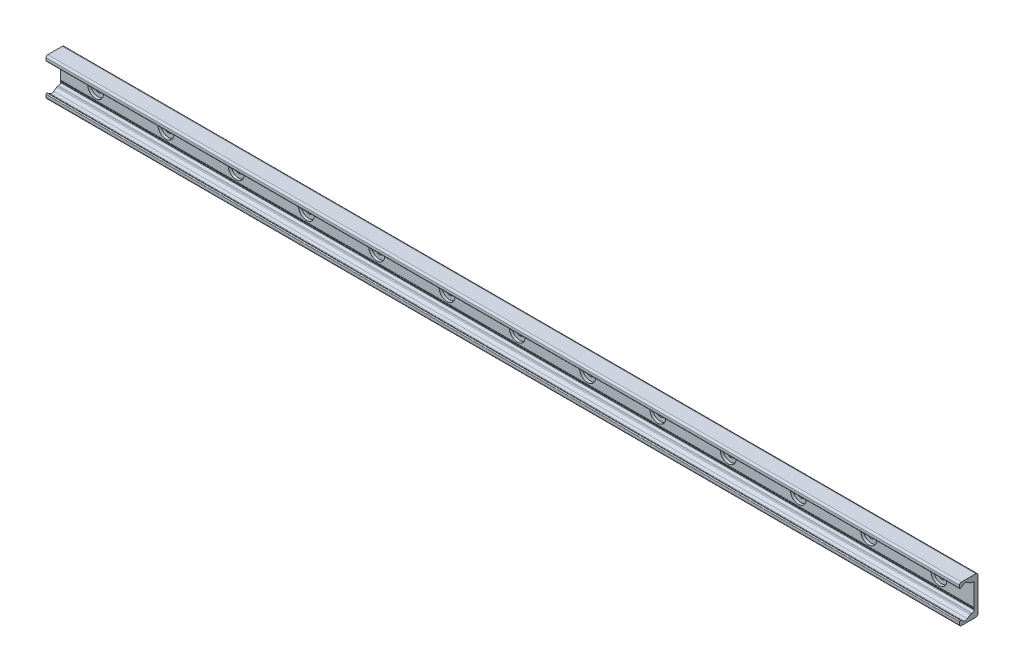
from build123d import *

# Parameters (mm, degrees)
BOSS_EXTRUDE1_DEPTH = 520
SKETCH2_R           = 9
SKETCH2_R_2         = 4.5
CUT_EXTRUDE1_DEPTH  = 3.1
SKETCH2_2_R         = 4.5
CUT_EXTRUDE2_DEPTH  = 521.705771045
LPATTERN1_COUNT     = 13
LPATTERN1_PITCH     = 80


with BuildPart() as part:
    # Sketch1 → Boss-Extrude1 (new, symmetric)
    with BuildSketch(Plane(origin=(0, 0, 0), x_dir=(0, 0, -1), z_dir=(1, 0, 0))):
        with BuildLine():
            Line((0, 0), (0, 19))
            ThreePointArc((0, 19), (-0.732233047, 20.767766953), (-2.5, 21.5))
            Line((-2.5, 21.5), (-19, 21.5))
            ThreePointArc((-19, 21.5), (-20.414213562, 20.914213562), (-21, 19.5))
            Line((-21, 19.5), (-21, 16.625057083))
            ThreePointArc((-21, 16.625057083), (-20.553251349, 15.888838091), (-19.693931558, 15.945160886))
            Line((-19.693931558, 15.945160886), (-16.794305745, 17.975500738))
            ThreePointArc((-16.794305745, 17.975500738), (-14.5, 18.69889256), (-12.205694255, 17.975500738))
            Line((-12.205694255, 17.975500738), (-8.829831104, 15.611695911))
            ThreePointArc((-8.829831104, 15.611695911), (-8.28408983, 15.342566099), (-7.682678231, 15.25))
            Line((-7.682678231, 15.25), (-6.5, 15.25))
            ThreePointArc((-6.5, 15.25), (-5.085786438, 14.664213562), (-4.5, 13.25))
            Line((-4.5, 13.25), (-4.5, -10.75))
            ThreePointArc((-4.5, -10.75), (-4.25, -11), (-4.5, -11.25))
            Line((-4.5, -11.25), (-4.5, -12.25))
            ThreePointArc((-4.5, -12.25), (-4.25, -12.5), (-4.5, -12.75))
            Line((-4.5, -12.75), (-4.5, -13.25))
            ThreePointArc((-4.5, -13.25), (-5.085786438, -14.664213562), (-6.5, -15.25))
            Line((-6.5, -15.25), (-7.682678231, -15.25))
            ThreePointArc((-7.682678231, -15.25), (-8.28408983, -15.342566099), (-8.829831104, -15.611695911))
            Line((-8.829831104, -15.611695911), (-12.205694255, -17.975500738))
            ThreePointArc((-12.205694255, -17.975500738), (-14.5, -18.69889256), (-16.794305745, -17.975500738))
            Line((-16.794305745, -17.975500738), (-19.693931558, -15.945160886))
            ThreePointArc((-19.693931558, -15.945160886), (-20.553251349, -15.888838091), (-21, -16.625057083))
            Line((-21, -16.625057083), (-21, -19.5))
            ThreePointArc((-21, -19.5), (-20.414213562, -20.914213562), (-19, -21.5))
            Line((-19, -21.5), (-2.5, -21.5))
            ThreePointArc((-2.5, -21.5), (-0.732233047, -20.767766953), (0, -19))
            Line((0, -19), (0, 0))
        make_face()
    extrude(amount=BOSS_EXTRUDE1_DEPTH, both=True)

    # Sketch2 → Cut-Extrude1 (cut)
    with BuildSketch(Plane.XY.offset(4.5)):
        with Locations((480, 0)):
            Circle(SKETCH2_R)
        with Locations((480, 0)):
            Circle(SKETCH2_R_2, mode=Mode.SUBTRACT)
    cut_extrude1 = extrude(amount=-CUT_EXTRUDE1_DEPTH, mode=Mode.SUBTRACT)

    # Sketch2_2 → Cut-Extrude2 (cut, through all)
    with BuildSketch(Plane.XY.offset(4.5)):
        with Locations((480, 0)):
            Circle(SKETCH2_2_R)
    cut_extrude2 = extrude(amount=-CUT_EXTRUDE2_DEPTH, mode=Mode.SUBTRACT)

    # LPattern1: Cut-Extrude1, Cut-Extrude2 ×13
    with Locations(*[(-i * LPATTERN1_PITCH, 0, 0) for i in range(1, LPATTERN1_COUNT)]):
        add(cut_extrude1, mode=Mode.SUBTRACT)
        add(cut_extrude2, mode=Mode.SUBTRACT)


solid = part.part
